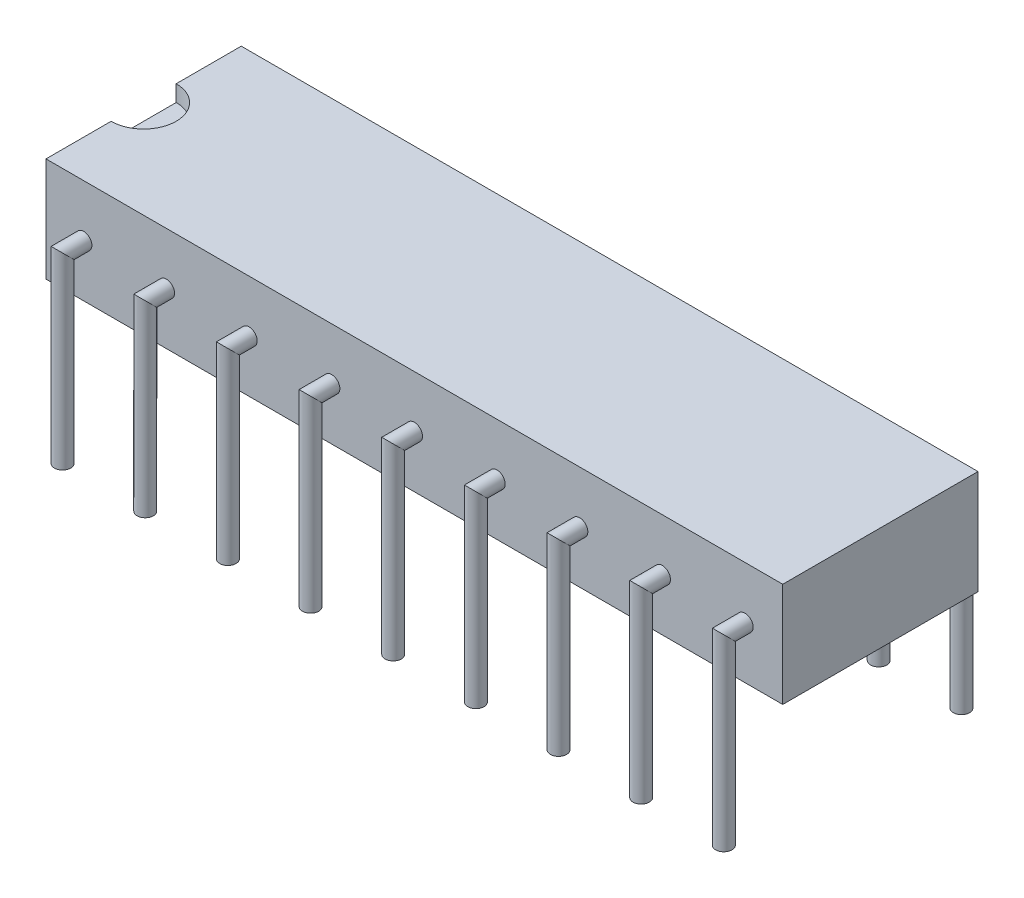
from build123d import *

# Parameters (mm, degrees)
ESQUISSE1_W                          = 6
ESQUISSE1_H                          = 3.2
EXTRUSION1_DEPTH                     = 22.64
ENL_V_MAT_EXTRU_1_DEPTH              = 0.5
ESQUISSE3_R                          = 0.25
R_P_TITION_LIN_AIRE1_COUNT           = 9
R_P_TITION_LIN_AIRE1_PITCH           = 2.54
R_P_TITION_LIN_AIRE1_COPY_1_SKETCH_R = 0.25
R_P_TITION_LIN_AIRE1_COPY_2_SKETCH_R = 0.25
R_P_TITION_LIN_AIRE1_COPY_3_SKETCH_R = 0.25
R_P_TITION_LIN_AIRE1_COPY_4_SKETCH_R = 0.25
R_P_TITION_LIN_AIRE1_COPY_5_SKETCH_R = 0.25
R_P_TITION_LIN_AIRE1_COPY_6_SKETCH_R = 0.25
R_P_TITION_LIN_AIRE1_COPY_7_SKETCH_R = 0.25
R_P_TITION_LIN_AIRE1_COPY_8_SKETCH_R = 0.25


with BuildPart() as part:
    # Esquisse1 → Extrusion1 (new body)
    with BuildSketch(Plane(origin=(0, 0, 0), x_dir=(0, 0, -1), z_dir=(1, 0, 0))):
        with Locations((0, 1.6)):
            Rectangle(ESQUISSE1_W, ESQUISSE1_H)
    extrude(amount=EXTRUSION1_DEPTH)

    # Esquisse2 → Enl_v. mat.-Extru.1 (cut)
    with BuildSketch(Plane(origin=(0, 3.2, 0), x_dir=(-1, 0, 0), z_dir=(0, 1, 0))):
        with BuildLine():
            Line((0, -1), (0, 1))
            ThreePointArc((0, 1), (-1, 0), (0, -1))
        make_face()
    extrude(amount=-ENL_V_MAT_EXTRU_1_DEPTH, mode=Mode.SUBTRACT)

    # Balayage1: sweep along a path in Esquisse5
    with BuildLine(Plane(origin=(1.16, 0, 0), x_dir=(0, 0, -1), z_dir=(1, 0, 0))) as balayage1_path:
        Line((-3, 1.6), (-3.65, 1.6))
        Line((-3.65, 1.6), (-3.65, -4))
    # Esquisse3 → Balayage1 (sweep)
    with BuildSketch(Plane.XY.offset(3)):
        with Locations((1.16, 1.6)):
            Circle(ESQUISSE3_R)
    balayage1 = sweep(path=balayage1_path.line, transition=Transition.RIGHT)

    # Sym_trie1: Balayage1 across plane
    add(balayage1.mirror(Plane.XY))

    # R_p_tition lin_aire1: Balayage1 ×9
    with Locations(*[(i * R_P_TITION_LIN_AIRE1_PITCH, 0, 0) for i in range(1, R_P_TITION_LIN_AIRE1_COUNT)]):
        add(balayage1)

    # R_p_tition lin_aire1 copy 1: sweep along a path in R_p_tition lin_aire1 copy 1 path
    with BuildLine(Plane(origin=(3.7, 0, 0), x_dir=(0, 0, 1), z_dir=(1, 0, 0))) as r_p_tition_lin_aire1_copy_1_path:
        Line((-3, -1.6), (-3.65, -1.6))
        Line((-3.65, -1.6), (-3.65, 4))
    # R_p_tition lin_aire1 copy 1 sketch → R_p_tition lin_aire1 copy 1 (sweep)
    with BuildSketch(Plane(origin=(2.54, 0, -3), x_dir=(1, 0, 0), z_dir=(0, 0, -1))):
        with Locations((1.16, -1.6)):
            Circle(R_P_TITION_LIN_AIRE1_COPY_1_SKETCH_R)
    sweep(path=r_p_tition_lin_aire1_copy_1_path.line, transition=Transition.RIGHT)

    # R_p_tition lin_aire1 copy 2: sweep along a path in R_p_tition lin_aire1 copy 2 path
    with BuildLine(Plane(origin=(6.24, 0, 0), x_dir=(0, 0, 1), z_dir=(1, 0, 0))) as r_p_tition_lin_aire1_copy_2_path:
        Line((-3, -1.6), (-3.65, -1.6))
        Line((-3.65, -1.6), (-3.65, 4))
    # R_p_tition lin_aire1 copy 2 sketch → R_p_tition lin_aire1 copy 2 (sweep)
    with BuildSketch(Plane(origin=(5.08, 0, -3), x_dir=(1, 0, 0), z_dir=(0, 0, -1))):
        with Locations((1.16, -1.6)):
            Circle(R_P_TITION_LIN_AIRE1_COPY_2_SKETCH_R)
    sweep(path=r_p_tition_lin_aire1_copy_2_path.line, transition=Transition.RIGHT)

    # R_p_tition lin_aire1 copy 3: sweep along a path in R_p_tition lin_aire1 copy 3 path
    with BuildLine(Plane(origin=(8.78, 0, 0), x_dir=(0, 0, 1), z_dir=(1, 0, 0))) as r_p_tition_lin_aire1_copy_3_path:
        Line((-3, -1.6), (-3.65, -1.6))
        Line((-3.65, -1.6), (-3.65, 4))
    # R_p_tition lin_aire1 copy 3 sketch → R_p_tition lin_aire1 copy 3 (sweep)
    with BuildSketch(Plane(origin=(7.62, 0, -3), x_dir=(1, 0, 0), z_dir=(0, 0, -1))):
        with Locations((1.16, -1.6)):
            Circle(R_P_TITION_LIN_AIRE1_COPY_3_SKETCH_R)
    sweep(path=r_p_tition_lin_aire1_copy_3_path.line, transition=Transition.RIGHT)

    # R_p_tition lin_aire1 copy 4: sweep along a path in R_p_tition lin_aire1 copy 4 path
    with BuildLine(Plane(origin=(11.32, 0, 0), x_dir=(0, 0, 1), z_dir=(1, 0, 0))) as r_p_tition_lin_aire1_copy_4_path:
        Line((-3, -1.6), (-3.65, -1.6))
        Line((-3.65, -1.6), (-3.65, 4))
    # R_p_tition lin_aire1 copy 4 sketch → R_p_tition lin_aire1 copy 4 (sweep)
    with BuildSketch(Plane(origin=(10.16, 0, -3), x_dir=(1, 0, 0), z_dir=(0, 0, -1))):
        with Locations((1.16, -1.6)):
            Circle(R_P_TITION_LIN_AIRE1_COPY_4_SKETCH_R)
    sweep(path=r_p_tition_lin_aire1_copy_4_path.line, transition=Transition.RIGHT)

    # R_p_tition lin_aire1 copy 5: sweep along a path in R_p_tition lin_aire1 copy 5 path
    with BuildLine(Plane(origin=(13.86, 0, 0), x_dir=(0, 0, 1), z_dir=(1, 0, 0))) as r_p_tition_lin_aire1_copy_5_path:
        Line((-3, -1.6), (-3.65, -1.6))
        Line((-3.65, -1.6), (-3.65, 4))
    # R_p_tition lin_aire1 copy 5 sketch → R_p_tition lin_aire1 copy 5 (sweep)
    with BuildSketch(Plane(origin=(12.7, 0, -3), x_dir=(1, 0, 0), z_dir=(0, 0, -1))):
        with Locations((1.16, -1.6)):
            Circle(R_P_TITION_LIN_AIRE1_COPY_5_SKETCH_R)
    sweep(path=r_p_tition_lin_aire1_copy_5_path.line, transition=Transition.RIGHT)

    # R_p_tition lin_aire1 copy 6: sweep along a path in R_p_tition lin_aire1 copy 6 path
    with BuildLine(Plane(origin=(16.4, 0, 0), x_dir=(0, 0, 1), z_dir=(1, 0, 0))) as r_p_tition_lin_aire1_copy_6_path:
        Line((-3, -1.6), (-3.65, -1.6))
        Line((-3.65, -1.6), (-3.65, 4))
    # R_p_tition lin_aire1 copy 6 sketch → R_p_tition lin_aire1 copy 6 (sweep)
    with BuildSketch(Plane(origin=(15.24, 0, -3), x_dir=(1, 0, 0), z_dir=(0, 0, -1))):
        with Locations((1.16, -1.6)):
            Circle(R_P_TITION_LIN_AIRE1_COPY_6_SKETCH_R)
    sweep(path=r_p_tition_lin_aire1_copy_6_path.line, transition=Transition.RIGHT)

    # R_p_tition lin_aire1 copy 7: sweep along a path in R_p_tition lin_aire1 copy 7 path
    with BuildLine(Plane(origin=(18.94, 0, 0), x_dir=(0, 0, 1), z_dir=(1, 0, 0))) as r_p_tition_lin_aire1_copy_7_path:
        Line((-3, -1.6), (-3.65, -1.6))
        Line((-3.65, -1.6), (-3.65, 4))
    # R_p_tition lin_aire1 copy 7 sketch → R_p_tition lin_aire1 copy 7 (sweep)
    with BuildSketch(Plane(origin=(17.78, 0, -3), x_dir=(1, 0, 0), z_dir=(0, 0, -1))):
        with Locations((1.16, -1.6)):
            Circle(R_P_TITION_LIN_AIRE1_COPY_7_SKETCH_R)
    sweep(path=r_p_tition_lin_aire1_copy_7_path.line, transition=Transition.RIGHT)

    # R_p_tition lin_aire1 copy 8: sweep along a path in R_p_tition lin_aire1 copy 8 path
    with BuildLine(Plane(origin=(21.48, 0, 0), x_dir=(0, 0, 1), z_dir=(1, 0, 0))) as r_p_tition_lin_aire1_copy_8_path:
        Line((-3, -1.6), (-3.65, -1.6))
        Line((-3.65, -1.6), (-3.65, 4))
    # R_p_tition lin_aire1 copy 8 sketch → R_p_tition lin_aire1 copy 8 (sweep)
    with BuildSketch(Plane(origin=(20.32, 0, -3), x_dir=(1, 0, 0), z_dir=(0, 0, -1))):
        with Locations((1.16, -1.6)):
            Circle(R_P_TITION_LIN_AIRE1_COPY_8_SKETCH_R)
    sweep(path=r_p_tition_lin_aire1_copy_8_path.line, transition=Transition.RIGHT)


solid = part.part
